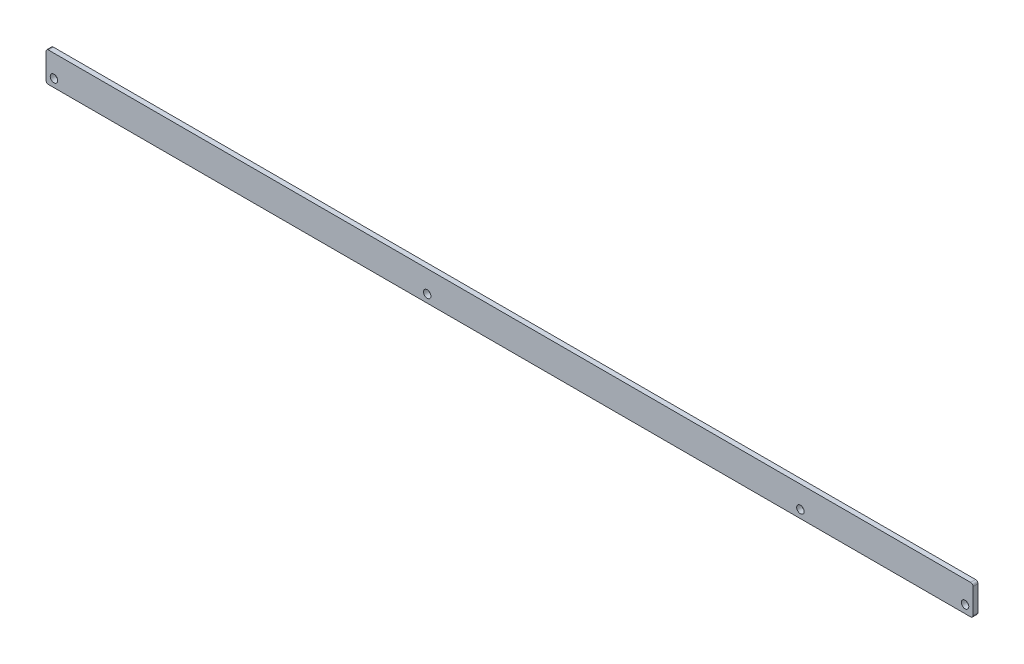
from build123d import *

# Parameters (mm, degrees)
BOSS_EXTRUDE1_DEPTH = 3.175
HOLE1_D             = 4.7625


with BuildPart() as part:
    # Sketch1 → Boss-Extrude1 (new body)
    with BuildSketch(Plane.XY):
        with BuildLine():
            Line((-1195.8882135, -200.025), (-608.3862135, -200.025))
            ThreePointArc((-608.3862135, -200.025), (-607.308582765, -199.578630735), (-606.8622135, -198.501))
            Line((-606.8622135, -198.501), (-606.8622135, -182.499))
            ThreePointArc((-606.8622135, -182.499), (-607.308582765, -181.421369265), (-608.3862135, -180.975))
            Line((-608.3862135, -180.975), (-1195.8882135, -180.975))
            ThreePointArc((-1195.8882135, -180.975), (-1196.965844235, -181.421369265), (-1197.4122135, -182.499))
            Line((-1197.4122135, -182.499), (-1197.4122135, -198.501))
            ThreePointArc((-1197.4122135, -198.501), (-1196.965844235, -199.578630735), (-1195.8882135, -200.025))
        make_face()
    extrude(amount=BOSS_EXTRUDE1_DEPTH)

    # Hole1 (through all)
    with Locations(Plane(origin=(-1195.986474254, -184.343859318, 3.175), x_dir=(1, 0, 0), z_dir=(0, 0, 1))):
        with Locations((3.654260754, -10.601140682), (584.044260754, -10.601140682), (479.156474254, -10.601140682), (241.405367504, -10.601140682)):
            Hole(HOLE1_D / 2)


solid = part.part
